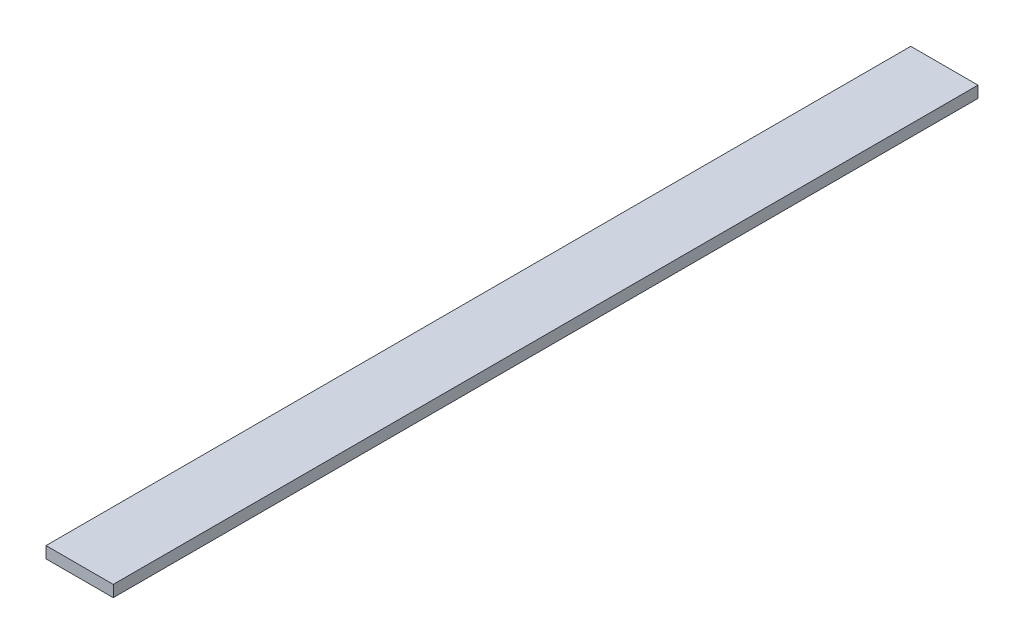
from build123d import *

# Parameters (mm, degrees)
CROQUIS1_W     = 35
CROQUIS1_H     = 6
EXTRUIR1_DEPTH = 225


with BuildPart() as part:
    # Croquis1 → Extruir1 (new, symmetric)
    with BuildSketch(Plane.XY):
        Rectangle(CROQUIS1_W, CROQUIS1_H)
    extrude(amount=EXTRUIR1_DEPTH, both=True)


solid = part.part
